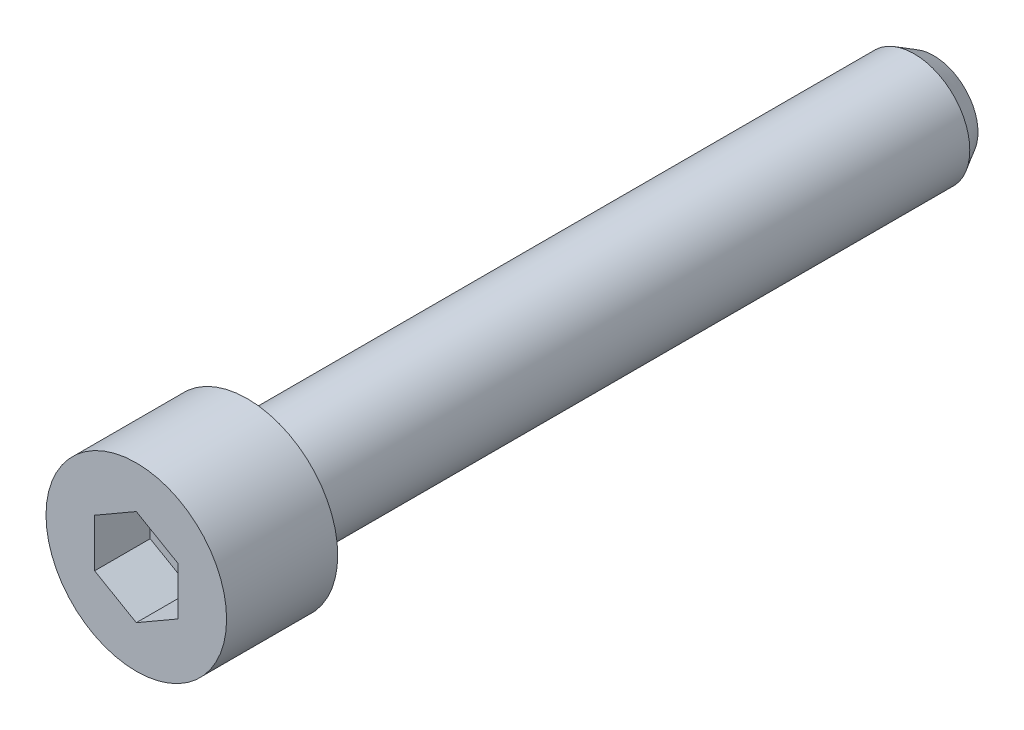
ISO-10303-21;
HEADER;
FILE_DESCRIPTION(('STEP AP214'),'2;1');
FILE_NAME('part.step','',(''),(''),'','','');
FILE_SCHEMA(('AUTOMOTIVE_DESIGN { 1 0 10303 214 1 1 1 1 }'));
ENDSEC;
DATA;
#1=APPLICATION_CONTEXT('core data for automotive mechanical design processes');
#2=APPLICATION_PROTOCOL_DEFINITION('international standard','automotive_design',2000,#1);
#3=PRODUCT_CONTEXT('',#1,'mechanical');
#4=PRODUCT('Part','Part','',(#3));
#5=PRODUCT_RELATED_PRODUCT_CATEGORY('part','',(#4));
#6=PRODUCT_DEFINITION_FORMATION('','',#4);
#7=PRODUCT_DEFINITION_CONTEXT('part definition',#1,'design');
#8=PRODUCT_DEFINITION('design','',#6,#7);
#9=PRODUCT_DEFINITION_SHAPE('','',#8);
#10=(LENGTH_UNIT() NAMED_UNIT(*) SI_UNIT(.MILLI.,.METRE.));
#11=(NAMED_UNIT(*) PLANE_ANGLE_UNIT() SI_UNIT($,.RADIAN.));
#12=(NAMED_UNIT(*) SI_UNIT($,.STERADIAN.) SOLID_ANGLE_UNIT());
#13=UNCERTAINTY_MEASURE_WITH_UNIT(LENGTH_MEASURE(1.E-05),#10,'distance_accuracy_value','');
#14=(GEOMETRIC_REPRESENTATION_CONTEXT(3) GLOBAL_UNCERTAINTY_ASSIGNED_CONTEXT((#13)) GLOBAL_UNIT_ASSIGNED_CONTEXT((#10,
#11,#12)) REPRESENTATION_CONTEXT('',''));
#15=CARTESIAN_POINT('',(0.,0.,0.));
#16=DIRECTION('',(0.,0.,1.));
#17=DIRECTION('',(1.,0.,0.));
#18=AXIS2_PLACEMENT_3D('',#15,#16,#17);
#19=CARTESIAN_POINT('',(0.,0.,1.45));
#20=DIRECTION('',(0.,0.,-1.));
#21=DIRECTION('',(1.,0.,0.));
#22=AXIS2_PLACEMENT_3D('',#19,#20,#21);
#23=SPHERICAL_SURFACE('',#22,2.75);
#24=CARTESIAN_POINT('',(0.,0.,0.601657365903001));
#25=DIRECTION('',(0.,0.,-1.));
#26=DIRECTION('',(1.,0.,0.));
#27=AXIS2_PLACEMENT_3D('',#24,#25,#26);
#28=CIRCLE('',#27,2.61587743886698);
#29=CARTESIAN_POINT('',(2.615877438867,0.,0.601657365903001));
#30=VERTEX_POINT('',#29);
#31=EDGE_CURVE('E9',#30,#30,#28,.T.);
#32=CARTESIAN_POINT('',(0.,0.,0.));
#33=DIRECTION('',(0.,0.,-1.));
#34=DIRECTION('',(1.,0.,0.));
#35=AXIS2_PLACEMENT_3D('',#32,#33,#34);
#36=CIRCLE('',#35,2.33666428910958);
#37=CARTESIAN_POINT('',(2.33666428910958,0.,0.));
#38=VERTEX_POINT('',#37);
#39=EDGE_CURVE('E17',#38,#38,#36,.F.);
#40=CARTESIAN_POINT('',(2.615877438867,0.,0.601657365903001));
#41=CARTESIAN_POINT('',(2.61374081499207,0.,0.595069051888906));
#42=CARTESIAN_POINT('',(2.6115793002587,0.,0.588488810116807));
#43=CARTESIAN_POINT('',(2.60720661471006,0.,0.575344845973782));
#44=CARTESIAN_POINT('',(2.60499544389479,0.,0.568781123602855));
#45=CARTESIAN_POINT('',(2.60052357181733,0.,0.555670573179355));
#46=CARTESIAN_POINT('',(2.59826287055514,0.,0.549123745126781));
#47=CARTESIAN_POINT('',(2.59369206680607,0.,0.536047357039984));
#48=CARTESIAN_POINT('',(2.59138196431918,0.,0.529517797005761));
#49=CARTESIAN_POINT('',(2.58671248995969,0.,0.516476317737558));
#50=CARTESIAN_POINT('',(2.58435311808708,0.,0.509964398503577));
#51=CARTESIAN_POINT('',(2.57958523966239,0.,0.496958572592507));
#52=CARTESIAN_POINT('',(2.57717673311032,0.,0.490464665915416));
#53=CARTESIAN_POINT('',(2.57231072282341,0.,0.477495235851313));
#54=CARTESIAN_POINT('',(2.56985321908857,0.,0.4710197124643));
#55=CARTESIAN_POINT('',(2.56488935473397,0.,0.458087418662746));
#56=CARTESIAN_POINT('',(2.56238299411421,0.,0.451630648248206));
#57=CARTESIAN_POINT('',(2.55732155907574,0.,0.43873622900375));
#58=CARTESIAN_POINT('',(2.55476648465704,0.,0.432298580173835));
#59=CARTESIAN_POINT('',(2.549607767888,0.,0.419442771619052));
#60=CARTESIAN_POINT('',(2.54700412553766,0.,0.413024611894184));
#61=CARTESIAN_POINT('',(2.54174842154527,0.,0.400208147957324));
#62=CARTESIAN_POINT('',(2.53909635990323,0.,0.393809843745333));
#63=CARTESIAN_POINT('',(2.5337439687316,0.,0.381033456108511));
#64=CARTESIAN_POINT('',(2.53104363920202,0.,0.374655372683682));
#65=CARTESIAN_POINT('',(2.52559486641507,0.,0.361919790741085));
#66=CARTESIAN_POINT('',(2.5228464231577,0.,0.355562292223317));
#67=CARTESIAN_POINT('',(2.51730157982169,0.,0.342868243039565));
#68=CARTESIAN_POINT('',(2.51450517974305,0.,0.33653169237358));
#69=CARTESIAN_POINT('',(2.50886458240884,0.,0.323879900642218));
#70=CARTESIAN_POINT('',(2.50602038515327,0.,0.317564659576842));
#71=CARTESIAN_POINT('',(2.50028435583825,0.,0.304955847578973));
#72=CARTESIAN_POINT('',(2.49739252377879,0.,0.298662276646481));
#73=CARTESIAN_POINT('',(2.49156138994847,0.,0.286097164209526));
#74=CARTESIAN_POINT('',(2.48862208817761,0.,0.279825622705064));
#75=CARTESIAN_POINT('',(2.48269618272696,0.,0.267304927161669));
#76=CARTESIAN_POINT('',(2.47970957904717,0.,0.261055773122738));
#77=CARTESIAN_POINT('',(2.4736892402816,0.,0.248580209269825));
#78=CARTESIAN_POINT('',(2.4706555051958,0.,0.242353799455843));
#79=CARTESIAN_POINT('',(2.46454107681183,0.,0.229924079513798));
#80=CARTESIAN_POINT('',(2.46146038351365,0.,0.223720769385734));
#81=CARTESIAN_POINT('',(2.45525221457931,0.,0.211337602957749));
#82=CARTESIAN_POINT('',(2.45212473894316,0.,0.205157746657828));
#83=CARTESIAN_POINT('',(2.44582318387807,0.,0.192821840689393));
#84=CARTESIAN_POINT('',(2.44264910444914,0.,0.186665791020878));
#85=CARTESIAN_POINT('',(2.43625452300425,0.,0.174377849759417));
#86=CARTESIAN_POINT('',(2.43303402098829,0.,0.168245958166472));
#87=CARTESIAN_POINT('',(2.42654677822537,0.,0.156006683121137));
#88=CARTESIAN_POINT('',(2.42328003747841,0.,0.149899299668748));
#89=CARTESIAN_POINT('',(2.41670050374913,0.,0.137709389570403));
#90=CARTESIAN_POINT('',(2.41338771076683,0.,0.131626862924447));
#91=CARTESIAN_POINT('',(2.40671626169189,0.,0.119487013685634));
#92=CARTESIAN_POINT('',(2.40335760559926,0.,0.113429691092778));
#93=CARTESIAN_POINT('',(2.39659462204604,0.,0.101340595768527));
#94=CARTESIAN_POINT('',(2.39319029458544,0.,0.0953088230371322));
#95=CARTESIAN_POINT('',(2.38633616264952,0.,0.0832711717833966));
#96=CARTESIAN_POINT('',(2.38288635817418,0.,0.0772652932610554));
#97=CARTESIAN_POINT('',(2.37594146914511,0.,0.0652797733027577));
#98=CARTESIAN_POINT('',(2.37244638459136,0.,0.0593001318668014));
#99=CARTESIAN_POINT('',(2.36541113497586,0.,0.0473674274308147));
#100=CARTESIAN_POINT('',(2.3618709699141,0.,0.0414143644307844));
#101=CARTESIAN_POINT('',(2.35474576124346,0.,0.0295351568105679));
#102=CARTESIAN_POINT('',(2.35116071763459,0.,0.0236090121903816));
#103=CARTESIAN_POINT('',(2.34394595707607,0.,0.0117839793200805));
#104=CARTESIAN_POINT('',(2.34031624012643,0.,0.00588509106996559));
#105=CARTESIAN_POINT('',(2.33666428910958,0.,0.));
#106=B_SPLINE_CURVE_WITH_KNOTS('',3,(#40,#41,#42,#43,#44,#45,#46,#47,#48,#49,#50,#51,#52,#53,
#54,#55,#56,#57,#58,#59,#60,#61,#62,#63,#64,#65,#66,#67,#68,#69,#70,#71,#72,#73,#74,#75,#76,#77,
#78,#79,#80,#81,#82,#83,#84,#85,#86,#87,#88,#89,#90,#91,#92,#93,#94,#95,#96,#97,#98,#99,#100,
#101,#102,#103,#104,#105),.UNSPECIFIED.,.F.,.F.,(4,2,2,2,2,2,2,2,2,2,2,2,2,2,2,2,2,2,2,2,2,2,2,
2,2,2,2,2,2,2,2,2,4),(0.,0.0207782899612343,0.0415565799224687,0.0623348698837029,
0.0831131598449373,0.103891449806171,0.124669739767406,0.14544802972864,0.166226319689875,
0.187004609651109,0.207782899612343,0.228561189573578,0.249339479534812,0.270117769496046,
0.29089605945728,0.311674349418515,0.332452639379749,0.353230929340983,0.374009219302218,
0.394787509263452,0.415565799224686,0.436344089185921,0.457122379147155,0.477900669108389,
0.498678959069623,0.519457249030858,0.540235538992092,0.561013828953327,0.581792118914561,
0.602570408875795,0.623348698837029,0.644126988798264,0.664905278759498),.UNSPECIFIED.);
#107=EDGE_CURVE('BSEAM14',#30,#38,#106,.T.);
#108=ORIENTED_EDGE('',*,*,#31,.T.);
#109=ORIENTED_EDGE('',*,*,#39,.T.);
#110=ORIENTED_EDGE('',*,*,#107,.T.);
#111=ORIENTED_EDGE('',*,*,#107,.F.);
#112=EDGE_LOOP('',(#108,#110,#109,#111));
#113=FACE_BOUND('',#112,.T.);
#114=ADVANCED_FACE('F14',(#113),#23,.T.);
#115=CARTESIAN_POINT('',(3.19170962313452,0.,0.601657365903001));
#116=DIRECTION('',(0.,0.,1.));
#117=DIRECTION('',(-1.,0.,0.));
#118=AXIS2_PLACEMENT_3D('',#115,#116,#117);
#119=PLANE('',#118);
#120=ORIENTED_EDGE('',*,*,#31,.F.);
#121=EDGE_LOOP('',(#120));
#122=FACE_BOUND('',#121,.T.);
#123=CARTESIAN_POINT('',(0.,0.,0.601657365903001));
#124=DIRECTION('',(0.,0.,-1.));
#125=DIRECTION('',(1.,0.,0.));
#126=AXIS2_PLACEMENT_3D('',#123,#124,#125);
#127=CIRCLE('',#126,3.19170962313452);
#128=CARTESIAN_POINT('',(3.19170962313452,0.,0.601657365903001));
#129=VERTEX_POINT('',#128);
#130=EDGE_CURVE('E22',#129,#129,#127,.T.);
#131=ORIENTED_EDGE('',*,*,#130,.T.);
#132=EDGE_LOOP('',(#131));
#133=FACE_BOUND('',#132,.T.);
#134=ADVANCED_FACE('F137',(#122,#133),#119,.F.);
#135=CARTESIAN_POINT('',(0.,0.,2.001657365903));
#136=DIRECTION('',(0.,0.,1.));
#137=DIRECTION('',(-1.,0.,0.));
#138=AXIS2_PLACEMENT_3D('',#135,#136,#137);
#139=CONICAL_SURFACE('',#138,4.,0.523598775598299);
#140=ORIENTED_EDGE('',*,*,#130,.F.);
#141=EDGE_LOOP('',(#140));
#142=FACE_BOUND('',#141,.T.);
#143=CARTESIAN_POINT('',(0.,0.,2.001657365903));
#144=DIRECTION('',(0.,0.,-1.));
#145=DIRECTION('',(1.,0.,0.));
#146=AXIS2_PLACEMENT_3D('',#143,#144,#145);
#147=CIRCLE('',#146,4.);
#148=CARTESIAN_POINT('',(4.,0.,2.001657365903));
#149=VERTEX_POINT('',#148);
#150=EDGE_CURVE('E131',#149,#149,#147,.T.);
#151=ORIENTED_EDGE('',*,*,#150,.T.);
#152=EDGE_LOOP('',(#151));
#153=FACE_BOUND('',#152,.T.);
#154=ADVANCED_FACE('F139',(#142,#153),#139,.T.);
#155=CARTESIAN_POINT('',(0.,0.,20.));
#156=DIRECTION('',(0.,0.,-1.));
#157=DIRECTION('',(1.,0.,0.));
#158=AXIS2_PLACEMENT_3D('',#155,#156,#157);
#159=CYLINDRICAL_SURFACE('',#158,4.);
#160=ORIENTED_EDGE('',*,*,#150,.F.);
#161=EDGE_LOOP('',(#160));
#162=FACE_BOUND('',#161,.T.);
#163=CARTESIAN_POINT('',(0.,0.,50.));
#164=DIRECTION('',(0.,0.,-1.));
#165=DIRECTION('',(1.,0.,0.));
#166=AXIS2_PLACEMENT_3D('',#163,#164,#165);
#167=CIRCLE('',#166,4.);
#168=CARTESIAN_POINT('',(4.,0.,50.));
#169=VERTEX_POINT('',#168);
#170=EDGE_CURVE('E128',#169,#169,#167,.T.);
#171=ORIENTED_EDGE('',*,*,#170,.T.);
#172=EDGE_LOOP('',(#171));
#173=FACE_BOUND('',#172,.T.);
#174=ADVANCED_FACE('F142',(#162,#173),#159,.T.);
#175=CARTESIAN_POINT('',(4.,0.,50.));
#176=DIRECTION('',(0.,0.,-1.));
#177=DIRECTION('',(1.,0.,0.));
#178=AXIS2_PLACEMENT_3D('',#175,#176,#177);
#179=PLANE('',#178);
#180=CARTESIAN_POINT('',(0.,0.,50.));
#181=DIRECTION('',(0.,0.,-1.));
#182=DIRECTION('',(1.,0.,0.));
#183=AXIS2_PLACEMENT_3D('',#180,#181,#182);
#184=CIRCLE('',#183,6.5);
#185=CARTESIAN_POINT('',(6.5,0.,50.));
#186=VERTEX_POINT('',#185);
#187=EDGE_CURVE('E125',#186,#186,#184,.T.);
#188=ORIENTED_EDGE('',*,*,#187,.T.);
#189=EDGE_LOOP('',(#188));
#190=FACE_BOUND('',#189,.T.);
#191=ORIENTED_EDGE('',*,*,#170,.F.);
#192=EDGE_LOOP('',(#191));
#193=FACE_BOUND('',#192,.T.);
#194=ADVANCED_FACE('F148',(#190,#193),#179,.T.);
#195=CARTESIAN_POINT('',(0.,0.,20.));
#196=DIRECTION('',(0.,0.,-1.));
#197=DIRECTION('',(1.,0.,0.));
#198=AXIS2_PLACEMENT_3D('',#195,#196,#197);
#199=CYLINDRICAL_SURFACE('',#198,6.5);
#200=CARTESIAN_POINT('',(0.,0.,58.));
#201=DIRECTION('',(0.,0.,-1.));
#202=DIRECTION('',(1.,0.,0.));
#203=AXIS2_PLACEMENT_3D('',#200,#201,#202);
#204=CIRCLE('',#203,6.5);
#205=CARTESIAN_POINT('',(6.5,0.,58.));
#206=VERTEX_POINT('',#205);
#207=EDGE_CURVE('E122',#206,#206,#204,.T.);
#208=ORIENTED_EDGE('',*,*,#207,.T.);
#209=EDGE_LOOP('',(#208));
#210=FACE_BOUND('',#209,.T.);
#211=ORIENTED_EDGE('',*,*,#187,.F.);
#212=EDGE_LOOP('',(#211));
#213=FACE_BOUND('',#212,.T.);
#214=ADVANCED_FACE('F153',(#210,#213),#199,.T.);
#215=CARTESIAN_POINT('',(6.5,0.,58.));
#216=DIRECTION('',(0.,0.,1.));
#217=DIRECTION('',(-1.,0.,0.));
#218=AXIS2_PLACEMENT_3D('',#215,#216,#217);
#219=PLANE('',#218);
#220=DIRECTION('',(-0.86602540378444,0.5,0.));
#221=VECTOR('',#220,1.);
#222=CARTESIAN_POINT('',(3.,1.73205080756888,58.));
#223=LINE('',#222,#221);
#224=CARTESIAN_POINT('',(3.,1.73205080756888,58.));
#225=VERTEX_POINT('',#224);
#226=CARTESIAN_POINT('',(0.,3.46410161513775,58.));
#227=VERTEX_POINT('',#226);
#228=EDGE_CURVE('E29',#225,#227,#223,.T.);
#229=ORIENTED_EDGE('',*,*,#228,.F.);
#230=DIRECTION('',(0.,1.,0.));
#231=VECTOR('',#230,1.);
#232=CARTESIAN_POINT('',(3.,-1.73205080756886,58.));
#233=LINE('',#232,#231);
#234=CARTESIAN_POINT('',(3.,-1.73205080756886,58.));
#235=VERTEX_POINT('',#234);
#236=EDGE_CURVE('E98',#235,#225,#233,.T.);
#237=ORIENTED_EDGE('',*,*,#236,.F.);
#238=DIRECTION('',(-0.866025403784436,-0.5,0.));
#239=VECTOR('',#238,1.);
#240=CARTESIAN_POINT('',(3.,-1.73205080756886,58.));
#241=LINE('',#240,#239);
#242=CARTESIAN_POINT('',(0.,-3.46410161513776,58.));
#243=VERTEX_POINT('',#242);
#244=EDGE_CURVE('E93',#235,#243,#241,.T.);
#245=ORIENTED_EDGE('',*,*,#244,.T.);
#246=DIRECTION('',(0.866025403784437,-0.5,0.));
#247=VECTOR('',#246,1.);
#248=CARTESIAN_POINT('',(-3.,-1.73205080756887,58.));
#249=LINE('',#248,#247);
#250=CARTESIAN_POINT('',(-3.,-1.73205080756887,58.));
#251=VERTEX_POINT('',#250);
#252=EDGE_CURVE('E91',#251,#243,#249,.T.);
#253=ORIENTED_EDGE('',*,*,#252,.F.);
#254=DIRECTION('',(0.,1.,0.));
#255=VECTOR('',#254,1.);
#256=CARTESIAN_POINT('',(-3.,-1.73205080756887,58.));
#257=LINE('',#256,#255);
#258=CARTESIAN_POINT('',(-3.,1.73205080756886,58.));
#259=VERTEX_POINT('',#258);
#260=EDGE_CURVE('E72',#251,#259,#257,.T.);
#261=ORIENTED_EDGE('',*,*,#260,.T.);
#262=DIRECTION('',(0.866025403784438,0.5,0.));
#263=VECTOR('',#262,1.);
#264=CARTESIAN_POINT('',(-3.,1.73205080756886,58.));
#265=LINE('',#264,#263);
#266=EDGE_CURVE('E83',#259,#227,#265,.T.);
#267=ORIENTED_EDGE('',*,*,#266,.T.);
#268=EDGE_LOOP('',(#229,#237,#245,#253,#261,#267));
#269=FACE_BOUND('',#268,.T.);
#270=ORIENTED_EDGE('',*,*,#207,.F.);
#271=EDGE_LOOP('',(#270));
#272=FACE_BOUND('',#271,.T.);
#273=ADVANCED_FACE('F87',(#269,#272),#219,.T.);
#274=CARTESIAN_POINT('',(3.,1.73205080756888,54.));
#275=DIRECTION('',(0.5,0.86602540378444,0.));
#276=DIRECTION('',(0.86602540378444,-0.5,0.));
#277=AXIS2_PLACEMENT_3D('',#274,#275,#276);
#278=PLANE('',#277);
#279=DIRECTION('',(0.,0.,1.));
#280=VECTOR('',#279,1.);
#281=CARTESIAN_POINT('',(3.,1.73205080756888,54.));
#282=LINE('',#281,#280);
#283=CARTESIAN_POINT('',(3.,1.73205080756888,54.));
#284=VERTEX_POINT('',#283);
#285=EDGE_CURVE('E36',#284,#225,#282,.T.);
#286=ORIENTED_EDGE('',*,*,#285,.T.);
#287=ORIENTED_EDGE('',*,*,#228,.T.);
#288=DIRECTION('',(0.,0.,1.));
#289=VECTOR('',#288,1.);
#290=CARTESIAN_POINT('',(0.,3.46410161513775,54.));
#291=LINE('',#290,#289);
#292=CARTESIAN_POINT('',(0.,3.46410161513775,54.));
#293=VERTEX_POINT('',#292);
#294=EDGE_CURVE('E80',#293,#227,#291,.T.);
#295=ORIENTED_EDGE('',*,*,#294,.F.);
#296=DIRECTION('',(-0.86602540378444,0.5,0.));
#297=VECTOR('',#296,1.);
#298=CARTESIAN_POINT('',(3.,1.73205080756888,54.));
#299=LINE('',#298,#297);
#300=EDGE_CURVE('E100',#284,#293,#299,.T.);
#301=ORIENTED_EDGE('',*,*,#300,.F.);
#302=EDGE_LOOP('',(#286,#287,#295,#301));
#303=FACE_BOUND('',#302,.T.);
#304=ADVANCED_FACE('F190',(#303),#278,.F.);
#305=CARTESIAN_POINT('',(3.,-1.73205080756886,54.));
#306=DIRECTION('',(1.,0.,0.));
#307=DIRECTION('',(0.,-1.,0.));
#308=AXIS2_PLACEMENT_3D('',#305,#306,#307);
#309=PLANE('',#308);
#310=DIRECTION('',(0.,0.,1.));
#311=VECTOR('',#310,1.);
#312=CARTESIAN_POINT('',(3.,-1.73205080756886,54.));
#313=LINE('',#312,#311);
#314=CARTESIAN_POINT('',(3.,-1.73205080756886,54.));
#315=VERTEX_POINT('',#314);
#316=EDGE_CURVE('E119',#315,#235,#313,.T.);
#317=ORIENTED_EDGE('',*,*,#316,.T.);
#318=ORIENTED_EDGE('',*,*,#236,.T.);
#319=ORIENTED_EDGE('',*,*,#285,.F.);
#320=DIRECTION('',(0.,1.,0.));
#321=VECTOR('',#320,1.);
#322=CARTESIAN_POINT('',(3.,-1.73205080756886,54.));
#323=LINE('',#322,#321);
#324=EDGE_CURVE('E112',#315,#284,#323,.T.);
#325=ORIENTED_EDGE('',*,*,#324,.F.);
#326=EDGE_LOOP('',(#317,#318,#319,#325));
#327=FACE_BOUND('',#326,.T.);
#328=ADVANCED_FACE('F198',(#327),#309,.F.);
#329=CARTESIAN_POINT('',(3.,-1.73205080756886,54.));
#330=DIRECTION('',(-0.5,0.866025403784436,0.));
#331=DIRECTION('',(0.866025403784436,0.5,0.));
#332=AXIS2_PLACEMENT_3D('',#329,#330,#331);
#333=PLANE('',#332);
#334=DIRECTION('',(0.,0.,1.));
#335=VECTOR('',#334,1.);
#336=CARTESIAN_POINT('',(0.,-3.46410161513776,54.));
#337=LINE('',#336,#335);
#338=CARTESIAN_POINT('',(0.,-3.46410161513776,54.));
#339=VERTEX_POINT('',#338);
#340=EDGE_CURVE('E117',#339,#243,#337,.T.);
#341=ORIENTED_EDGE('',*,*,#340,.T.);
#342=ORIENTED_EDGE('',*,*,#244,.F.);
#343=ORIENTED_EDGE('',*,*,#316,.F.);
#344=DIRECTION('',(-0.866025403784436,-0.5,0.));
#345=VECTOR('',#344,1.);
#346=CARTESIAN_POINT('',(3.,-1.73205080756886,54.));
#347=LINE('',#346,#345);
#348=EDGE_CURVE('E109',#315,#339,#347,.T.);
#349=ORIENTED_EDGE('',*,*,#348,.T.);
#350=EDGE_LOOP('',(#341,#342,#343,#349));
#351=FACE_BOUND('',#350,.T.);
#352=ADVANCED_FACE('F194',(#351),#333,.T.);
#353=CARTESIAN_POINT('',(-3.,-1.73205080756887,54.));
#354=DIRECTION('',(-0.5,-0.866025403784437,0.));
#355=DIRECTION('',(-0.866025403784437,0.5,0.));
#356=AXIS2_PLACEMENT_3D('',#353,#354,#355);
#357=PLANE('',#356);
#358=DIRECTION('',(0.,0.,1.));
#359=VECTOR('',#358,1.);
#360=CARTESIAN_POINT('',(-3.,-1.73205080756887,54.));
#361=LINE('',#360,#359);
#362=CARTESIAN_POINT('',(-3.,-1.73205080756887,54.));
#363=VERTEX_POINT('',#362);
#364=EDGE_CURVE('E79',#363,#251,#361,.T.);
#365=ORIENTED_EDGE('',*,*,#364,.T.);
#366=ORIENTED_EDGE('',*,*,#252,.T.);
#367=ORIENTED_EDGE('',*,*,#340,.F.);
#368=DIRECTION('',(0.866025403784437,-0.5,0.));
#369=VECTOR('',#368,1.);
#370=CARTESIAN_POINT('',(-3.,-1.73205080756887,54.));
#371=LINE('',#370,#369);
#372=EDGE_CURVE('E106',#363,#339,#371,.T.);
#373=ORIENTED_EDGE('',*,*,#372,.F.);
#374=EDGE_LOOP('',(#365,#366,#367,#373));
#375=FACE_BOUND('',#374,.T.);
#376=ADVANCED_FACE('F187',(#375),#357,.F.);
#377=CARTESIAN_POINT('',(-3.,-1.73205080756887,54.));
#378=DIRECTION('',(1.,0.,0.));
#379=DIRECTION('',(0.,-1.,0.));
#380=AXIS2_PLACEMENT_3D('',#377,#378,#379);
#381=PLANE('',#380);
#382=DIRECTION('',(0.,0.,1.));
#383=VECTOR('',#382,1.);
#384=CARTESIAN_POINT('',(-3.,1.73205080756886,54.));
#385=LINE('',#384,#383);
#386=CARTESIAN_POINT('',(-3.,1.73205080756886,54.));
#387=VERTEX_POINT('',#386);
#388=EDGE_CURVE('E68',#387,#259,#385,.T.);
#389=ORIENTED_EDGE('',*,*,#388,.T.);
#390=ORIENTED_EDGE('',*,*,#260,.F.);
#391=ORIENTED_EDGE('',*,*,#364,.F.);
#392=DIRECTION('',(0.,1.,0.));
#393=VECTOR('',#392,1.);
#394=CARTESIAN_POINT('',(-3.,-1.73205080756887,54.));
#395=LINE('',#394,#393);
#396=EDGE_CURVE('E75',#363,#387,#395,.T.);
#397=ORIENTED_EDGE('',*,*,#396,.T.);
#398=EDGE_LOOP('',(#389,#390,#391,#397));
#399=FACE_BOUND('',#398,.T.);
#400=ADVANCED_FACE('F70',(#399),#381,.T.);
#401=CARTESIAN_POINT('',(-3.,1.73205080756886,54.));
#402=DIRECTION('',(0.5,-0.866025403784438,0.));
#403=DIRECTION('',(-0.866025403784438,-0.5,0.));
#404=AXIS2_PLACEMENT_3D('',#401,#402,#403);
#405=PLANE('',#404);
#406=DIRECTION('',(0.866025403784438,0.5,0.));
#407=VECTOR('',#406,1.);
#408=CARTESIAN_POINT('',(-3.,1.73205080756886,54.));
#409=LINE('',#408,#407);
#410=EDGE_CURVE('E103',#387,#293,#409,.T.);
#411=ORIENTED_EDGE('',*,*,#410,.T.);
#412=ORIENTED_EDGE('',*,*,#294,.T.);
#413=ORIENTED_EDGE('',*,*,#266,.F.);
#414=ORIENTED_EDGE('',*,*,#388,.F.);
#415=EDGE_LOOP('',(#411,#412,#413,#414));
#416=FACE_BOUND('',#415,.T.);
#417=ADVANCED_FACE('F84',(#416),#405,.T.);
#418=CARTESIAN_POINT('',(6.,0.,54.));
#419=DIRECTION('',(0.,0.,1.));
#420=DIRECTION('',(-1.,0.,0.));
#421=AXIS2_PLACEMENT_3D('',#418,#419,#420);
#422=PLANE('',#421);
#423=ORIENTED_EDGE('',*,*,#300,.T.);
#424=ORIENTED_EDGE('',*,*,#410,.F.);
#425=ORIENTED_EDGE('',*,*,#396,.F.);
#426=ORIENTED_EDGE('',*,*,#372,.T.);
#427=ORIENTED_EDGE('',*,*,#348,.F.);
#428=ORIENTED_EDGE('',*,*,#324,.T.);
#429=EDGE_LOOP('',(#423,#424,#425,#426,#427,#428));
#430=FACE_BOUND('',#429,.T.);
#431=ADVANCED_FACE('F175',(#430),#422,.T.);
#432=CARTESIAN_POINT('',(0.,0.,0.));
#433=DIRECTION('',(0.,0.,-1.));
#434=DIRECTION('',(1.,0.,0.));
#435=AXIS2_PLACEMENT_3D('',#432,#433,#434);
#436=PLANE('',#435);
#437=ORIENTED_EDGE('',*,*,#39,.F.);
#438=EDGE_LOOP('',(#437));
#439=FACE_BOUND('',#438,.T.);
#440=ADVANCED_FACE('F173',(#439),#436,.T.);
#441=CLOSED_SHELL('',(#114,#134,#154,#174,#194,#214,#273,#304,#328,#352,#376,#400,#417,#431,#440));
#442=MANIFOLD_SOLID_BREP('B1',#441);
#443=ADVANCED_BREP_SHAPE_REPRESENTATION('',(#18,#442),#14);
#444=SHAPE_DEFINITION_REPRESENTATION(#9,#443);
ENDSEC;
END-ISO-10303-21;
